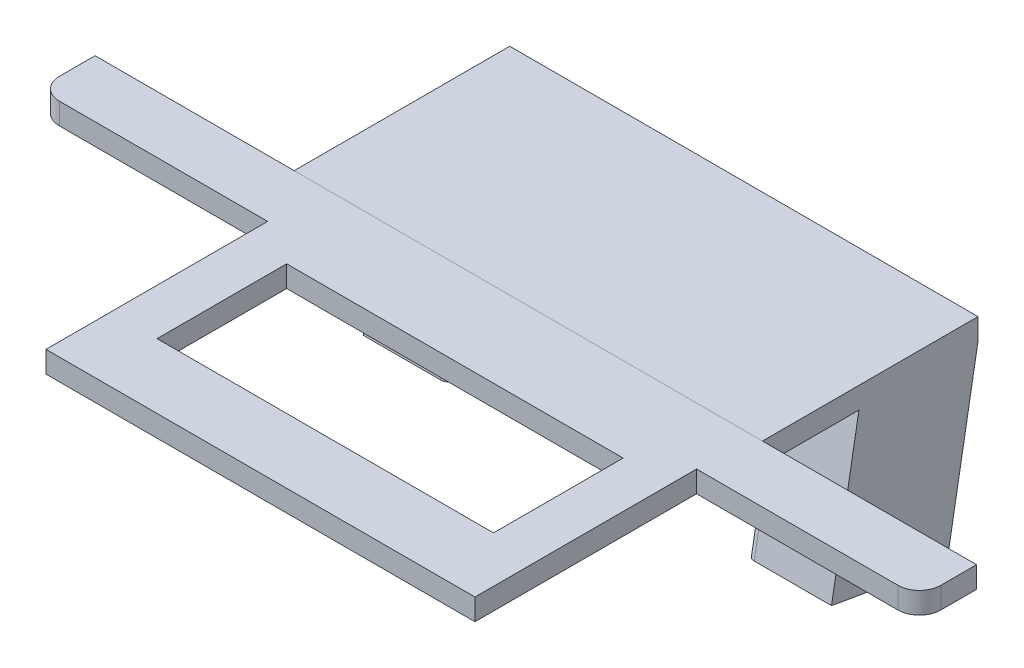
ISO-10303-21;
HEADER;
FILE_DESCRIPTION(('STEP AP214'),'2;1');
FILE_NAME('part.step','',(''),(''),'','','');
FILE_SCHEMA(('AUTOMOTIVE_DESIGN { 1 0 10303 214 1 1 1 1 }'));
ENDSEC;
DATA;
#1=APPLICATION_CONTEXT('core data for automotive mechanical design processes');
#2=APPLICATION_PROTOCOL_DEFINITION('international standard','automotive_design',2000,#1);
#3=PRODUCT_CONTEXT('',#1,'mechanical');
#4=PRODUCT('Part','Part','',(#3));
#5=PRODUCT_RELATED_PRODUCT_CATEGORY('part','',(#4));
#6=PRODUCT_DEFINITION_FORMATION('','',#4);
#7=PRODUCT_DEFINITION_CONTEXT('part definition',#1,'design');
#8=PRODUCT_DEFINITION('design','',#6,#7);
#9=PRODUCT_DEFINITION_SHAPE('','',#8);
#10=(LENGTH_UNIT() NAMED_UNIT(*) SI_UNIT(.MILLI.,.METRE.));
#11=(NAMED_UNIT(*) PLANE_ANGLE_UNIT() SI_UNIT($,.RADIAN.));
#12=(NAMED_UNIT(*) SI_UNIT($,.STERADIAN.) SOLID_ANGLE_UNIT());
#13=UNCERTAINTY_MEASURE_WITH_UNIT(LENGTH_MEASURE(1.E-05),#10,'distance_accuracy_value','');
#14=(GEOMETRIC_REPRESENTATION_CONTEXT(3) GLOBAL_UNCERTAINTY_ASSIGNED_CONTEXT((#13)) GLOBAL_UNIT_ASSIGNED_CONTEXT((#10,
#11,#12)) REPRESENTATION_CONTEXT('',''));
#15=CARTESIAN_POINT('',(0.,0.,0.));
#16=DIRECTION('',(0.,0.,1.));
#17=DIRECTION('',(1.,0.,0.));
#18=AXIS2_PLACEMENT_3D('',#15,#16,#17);
#19=CARTESIAN_POINT('',(0.,-18.7801966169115,3.31145536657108));
#20=DIRECTION('',(0.,-0.984807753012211,0.173648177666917));
#21=DIRECTION('',(0.,-0.173648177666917,-0.98480775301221));
#22=AXIS2_PLACEMENT_3D('',#19,#20,#21);
#23=PLANE('',#22);
#24=DIRECTION('',(-1.,0.,0.));
#25=VECTOR('',#24,1.);
#26=CARTESIAN_POINT('',(-2.48583846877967,-22.1196600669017,-15.6275829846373));
#27=LINE('',#26,#25);
#28=CARTESIAN_POINT('',(6.51416153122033,-22.1196600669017,-15.6275829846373));
#29=VERTEX_POINT('',#28);
#30=CARTESIAN_POINT('',(-2.48583846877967,-22.1196600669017,-15.6275829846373));
#31=VERTEX_POINT('',#30);
#32=EDGE_CURVE('E246',#29,#31,#27,.T.);
#33=ORIENTED_EDGE('',*,*,#32,.F.);
#34=CARTESIAN_POINT('',(6.51416153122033,-21.9460118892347,-14.6427752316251));
#35=DIRECTION('',(0.,-0.984807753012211,0.173648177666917));
#36=DIRECTION('',(0.,-0.173648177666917,-0.98480775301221));
#37=AXIS2_PLACEMENT_3D('',#34,#35,#36);
#38=CIRCLE('',#37,1.);
#39=CARTESIAN_POINT('',(7.51416153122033,-21.9460118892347,-14.6427752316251));
#40=VERTEX_POINT('',#39);
#41=EDGE_CURVE('E345',#29,#40,#38,.T.);
#42=ORIENTED_EDGE('',*,*,#41,.T.);
#43=CARTESIAN_POINT('',(6.51416153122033,-21.9460118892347,-14.6427752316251));
#44=DIRECTION('',(0.,-0.984807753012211,0.173648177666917));
#45=DIRECTION('',(0.,-0.173648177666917,-0.98480775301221));
#46=AXIS2_PLACEMENT_3D('',#43,#44,#45);
#47=CIRCLE('',#46,1.);
#48=CARTESIAN_POINT('',(6.51416153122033,-21.7723637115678,-13.6579674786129));
#49=VERTEX_POINT('',#48);
#50=EDGE_CURVE('E336',#40,#49,#47,.T.);
#51=ORIENTED_EDGE('',*,*,#50,.T.);
#52=DIRECTION('',(-1.,0.,0.));
#53=VECTOR('',#52,1.);
#54=CARTESIAN_POINT('',(61.2141615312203,-21.7723637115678,-13.6579674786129));
#55=LINE('',#54,#53);
#56=CARTESIAN_POINT('',(-4.28583846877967,-21.7723637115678,-13.6579674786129));
#57=VERTEX_POINT('',#56);
#58=EDGE_CURVE('E263',#49,#57,#55,.T.);
#59=ORIENTED_EDGE('',*,*,#58,.T.);
#60=DIRECTION('',(0.,-0.173648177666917,-0.98480775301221));
#61=VECTOR('',#60,1.);
#62=CARTESIAN_POINT('',(-4.28583846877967,-24.6201938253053,-29.8088146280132));
#63=LINE('',#62,#61);
#64=CARTESIAN_POINT('',(-4.28583846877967,-24.6201938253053,-29.8088146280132));
#65=VERTEX_POINT('',#64);
#66=EDGE_CURVE('E267',#57,#65,#63,.T.);
#67=ORIENTED_EDGE('',*,*,#66,.T.);
#68=DIRECTION('',(1.,0.,0.));
#69=VECTOR('',#68,1.);
#70=CARTESIAN_POINT('',(61.2141615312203,-24.6201938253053,-29.8088146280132));
#71=LINE('',#70,#69);
#72=CARTESIAN_POINT('',(6.51416153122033,-24.6201938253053,-29.8088146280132));
#73=VERTEX_POINT('',#72);
#74=EDGE_CURVE('E270',#65,#73,#71,.T.);
#75=ORIENTED_EDGE('',*,*,#74,.T.);
#76=CARTESIAN_POINT('',(6.51416153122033,-24.4465456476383,-28.8240068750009));
#77=DIRECTION('',(0.,-0.984807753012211,0.173648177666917));
#78=DIRECTION('',(0.,-0.173648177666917,-0.98480775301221));
#79=AXIS2_PLACEMENT_3D('',#76,#77,#78);
#80=CIRCLE('',#79,1.);
#81=CARTESIAN_POINT('',(7.51416153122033,-24.4465456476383,-28.8240068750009));
#82=VERTEX_POINT('',#81);
#83=EDGE_CURVE('E328',#73,#82,#80,.T.);
#84=ORIENTED_EDGE('',*,*,#83,.T.);
#85=CARTESIAN_POINT('',(6.51416153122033,-24.4465456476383,-28.8240068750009));
#86=DIRECTION('',(0.,-0.984807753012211,0.173648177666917));
#87=DIRECTION('',(0.,-0.173648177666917,-0.98480775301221));
#88=AXIS2_PLACEMENT_3D('',#85,#86,#87);
#89=CIRCLE('',#88,1.);
#90=CARTESIAN_POINT('',(6.51416153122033,-24.2728974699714,-27.8391991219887));
#91=VERTEX_POINT('',#90);
#92=EDGE_CURVE('E319',#82,#91,#89,.T.);
#93=ORIENTED_EDGE('',*,*,#92,.T.);
#94=DIRECTION('',(1.,0.,0.));
#95=VECTOR('',#94,1.);
#96=CARTESIAN_POINT('',(7.51416153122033,-24.2728974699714,-27.8391991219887));
#97=LINE('',#96,#95);
#98=CARTESIAN_POINT('',(-2.48583846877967,-24.2728974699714,-27.8391991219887));
#99=VERTEX_POINT('',#98);
#100=EDGE_CURVE('E251',#99,#91,#97,.T.);
#101=ORIENTED_EDGE('',*,*,#100,.F.);
#102=DIRECTION('',(0.,-0.173648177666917,-0.98480775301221));
#103=VECTOR('',#102,1.);
#104=CARTESIAN_POINT('',(-2.48583846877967,-24.2728974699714,-27.8391991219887));
#105=LINE('',#104,#103);
#106=EDGE_CURVE('E248',#31,#99,#105,.T.);
#107=ORIENTED_EDGE('',*,*,#106,.F.);
#108=EDGE_LOOP('',(#33,#42,#51,#59,#67,#75,#84,#93,#101,#107));
#109=FACE_BOUND('',#108,.T.);
#110=ADVANCED_FACE('F47',(#109),#23,.T.);
#111=CARTESIAN_POINT('',(0.,0.,0.));
#112=DIRECTION('',(0.,-1.,0.));
#113=DIRECTION('',(0.,0.,-1.));
#114=AXIS2_PLACEMENT_3D('',#111,#112,#113);
#115=PLANE('',#114);
#116=DIRECTION('',(0.,0.,-1.));
#117=VECTOR('',#116,1.);
#118=CARTESIAN_POINT('',(-4.28583846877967,0.,0.));
#119=LINE('',#118,#117);
#120=CARTESIAN_POINT('',(-4.28583846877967,0.,-4.));
#121=VERTEX_POINT('',#120);
#122=CARTESIAN_POINT('',(-4.28583846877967,0.,-17.4970226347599));
#123=VERTEX_POINT('',#122);
#124=EDGE_CURVE('E302',#121,#123,#119,.T.);
#125=ORIENTED_EDGE('',*,*,#124,.T.);
#126=DIRECTION('',(1.,0.,0.));
#127=VECTOR('',#126,1.);
#128=CARTESIAN_POINT('',(0.,0.,-17.4970226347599));
#129=LINE('',#128,#127);
#130=CARTESIAN_POINT('',(61.2141615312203,0.,-17.4970226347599));
#131=VERTEX_POINT('',#130);
#132=EDGE_CURVE('E308',#123,#131,#129,.T.);
#133=ORIENTED_EDGE('',*,*,#132,.T.);
#134=DIRECTION('',(0.,0.,-1.));
#135=VECTOR('',#134,1.);
#136=CARTESIAN_POINT('',(61.2141615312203,0.,0.));
#137=LINE('',#136,#135);
#138=CARTESIAN_POINT('',(61.2141615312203,0.,-4.));
#139=VERTEX_POINT('',#138);
#140=EDGE_CURVE('E285',#139,#131,#137,.T.);
#141=ORIENTED_EDGE('',*,*,#140,.F.);
#142=DIRECTION('',(1.,0.,0.));
#143=VECTOR('',#142,1.);
#144=CARTESIAN_POINT('',(0.,0.,-4.));
#145=LINE('',#144,#143);
#146=EDGE_CURVE('E300',#121,#139,#145,.T.);
#147=ORIENTED_EDGE('',*,*,#146,.F.);
#148=EDGE_LOOP('',(#125,#133,#141,#147));
#149=FACE_BOUND('',#148,.T.);
#150=ADVANCED_FACE('F460',(#149),#115,.T.);
#151=CARTESIAN_POINT('',(61.2141615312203,3.,0.));
#152=DIRECTION('',(-1.,0.,0.));
#153=DIRECTION('',(0.,0.,1.));
#154=AXIS2_PLACEMENT_3D('',#151,#152,#153);
#155=PLANE('',#154);
#156=ORIENTED_EDGE('',*,*,#140,.T.);
#157=DIRECTION('',(0.,0.98480775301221,-0.173648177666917));
#158=VECTOR('',#157,1.);
#159=CARTESIAN_POINT('',(61.2141615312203,-21.7723637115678,-13.6579674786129));
#160=LINE('',#159,#158);
#161=CARTESIAN_POINT('',(61.2141615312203,-21.7723637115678,-13.6579674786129));
#162=VERTEX_POINT('',#161);
#163=EDGE_CURVE('E282',#162,#131,#160,.T.);
#164=ORIENTED_EDGE('',*,*,#163,.F.);
#165=DIRECTION('',(0.,0.173648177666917,0.98480775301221));
#166=VECTOR('',#165,1.);
#167=CARTESIAN_POINT('',(61.2141615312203,-24.6201938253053,-29.8088146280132));
#168=LINE('',#167,#166);
#169=CARTESIAN_POINT('',(61.2141615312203,-24.6201938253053,-29.8088146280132));
#170=VERTEX_POINT('',#169);
#171=EDGE_CURVE('E256',#170,#162,#168,.T.);
#172=ORIENTED_EDGE('',*,*,#171,.F.);
#173=DIRECTION('',(0.,0.98480775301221,-0.173648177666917));
#174=VECTOR('',#173,1.);
#175=CARTESIAN_POINT('',(61.2141615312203,-24.6201938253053,-29.8088146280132));
#176=LINE('',#175,#174);
#177=CARTESIAN_POINT('',(61.2141615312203,0.,-34.1500190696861));
#178=VERTEX_POINT('',#177);
#179=EDGE_CURVE('E273',#170,#178,#176,.T.);
#180=ORIENTED_EDGE('',*,*,#179,.T.);
#181=DIRECTION('',(0.,-1.,0.));
#182=VECTOR('',#181,1.);
#183=CARTESIAN_POINT('',(61.2141615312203,3.,-34.1500190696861));
#184=LINE('',#183,#182);
#185=CARTESIAN_POINT('',(61.2141615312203,3.,-34.1500190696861));
#186=VERTEX_POINT('',#185);
#187=EDGE_CURVE('E306',#186,#178,#184,.T.);
#188=ORIENTED_EDGE('',*,*,#187,.F.);
#189=DIRECTION('',(0.,0.,-1.));
#190=VECTOR('',#189,1.);
#191=CARTESIAN_POINT('',(61.2141615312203,3.,0.));
#192=LINE('',#191,#190);
#193=CARTESIAN_POINT('',(61.2141615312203,3.,-4.));
#194=VERTEX_POINT('',#193);
#195=EDGE_CURVE('E286',#194,#186,#192,.T.);
#196=ORIENTED_EDGE('',*,*,#195,.F.);
#197=DIRECTION('',(0.,-1.,0.));
#198=VECTOR('',#197,1.);
#199=CARTESIAN_POINT('',(61.2141615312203,3.,-4.));
#200=LINE('',#199,#198);
#201=EDGE_CURVE('E297',#194,#139,#200,.T.);
#202=ORIENTED_EDGE('',*,*,#201,.T.);
#203=EDGE_LOOP('',(#156,#164,#172,#180,#188,#196,#202));
#204=FACE_BOUND('',#203,.T.);
#205=ADVANCED_FACE('F400',(#204),#155,.F.);
#206=CARTESIAN_POINT('',(0.,3.,-34.1500190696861));
#207=DIRECTION('',(0.,0.,-1.));
#208=DIRECTION('',(-1.,0.,0.));
#209=AXIS2_PLACEMENT_3D('',#206,#207,#208);
#210=PLANE('',#209);
#211=DIRECTION('',(1.,0.,0.));
#212=VECTOR('',#211,1.);
#213=CARTESIAN_POINT('',(0.,0.,-34.1500190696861));
#214=LINE('',#213,#212);
#215=CARTESIAN_POINT('',(-4.28583846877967,0.,-34.1500190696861));
#216=VERTEX_POINT('',#215);
#217=EDGE_CURVE('E289',#216,#178,#214,.T.);
#218=ORIENTED_EDGE('',*,*,#217,.F.);
#219=DIRECTION('',(0.,-1.,0.));
#220=VECTOR('',#219,1.);
#221=CARTESIAN_POINT('',(-4.28583846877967,3.,-34.1500190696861));
#222=LINE('',#221,#220);
#223=CARTESIAN_POINT('',(-4.28583846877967,3.,-34.1500190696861));
#224=VERTEX_POINT('',#223);
#225=EDGE_CURVE('E309',#224,#216,#222,.T.);
#226=ORIENTED_EDGE('',*,*,#225,.F.);
#227=DIRECTION('',(1.,0.,0.));
#228=VECTOR('',#227,1.);
#229=CARTESIAN_POINT('',(0.,3.,-34.1500190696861));
#230=LINE('',#229,#228);
#231=EDGE_CURVE('E294',#224,#186,#230,.T.);
#232=ORIENTED_EDGE('',*,*,#231,.T.);
#233=ORIENTED_EDGE('',*,*,#187,.T.);
#234=EDGE_LOOP('',(#218,#226,#232,#233));
#235=FACE_BOUND('',#234,.T.);
#236=ADVANCED_FACE('F451',(#235),#210,.T.);
#237=CARTESIAN_POINT('',(-4.28583846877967,3.,0.));
#238=DIRECTION('',(-1.,0.,0.));
#239=DIRECTION('',(0.,0.,1.));
#240=AXIS2_PLACEMENT_3D('',#237,#238,#239);
#241=PLANE('',#240);
#242=DIRECTION('',(0.,0.98480775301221,-0.173648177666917));
#243=VECTOR('',#242,1.);
#244=CARTESIAN_POINT('',(-4.28583846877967,-21.7723637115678,-13.6579674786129));
#245=LINE('',#244,#243);
#246=EDGE_CURVE('E279',#57,#123,#245,.T.);
#247=ORIENTED_EDGE('',*,*,#246,.T.);
#248=ORIENTED_EDGE('',*,*,#124,.F.);
#249=DIRECTION('',(0.,-1.,0.));
#250=VECTOR('',#249,1.);
#251=CARTESIAN_POINT('',(-4.28583846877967,3.,-4.));
#252=LINE('',#251,#250);
#253=CARTESIAN_POINT('',(-4.28583846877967,3.,-4.));
#254=VERTEX_POINT('',#253);
#255=EDGE_CURVE('E311',#254,#121,#252,.T.);
#256=ORIENTED_EDGE('',*,*,#255,.F.);
#257=DIRECTION('',(0.,0.,-1.));
#258=VECTOR('',#257,1.);
#259=CARTESIAN_POINT('',(-4.28583846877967,3.,0.));
#260=LINE('',#259,#258);
#261=EDGE_CURVE('E291',#254,#224,#260,.T.);
#262=ORIENTED_EDGE('',*,*,#261,.T.);
#263=ORIENTED_EDGE('',*,*,#225,.T.);
#264=DIRECTION('',(0.,0.98480775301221,-0.173648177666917));
#265=VECTOR('',#264,1.);
#266=CARTESIAN_POINT('',(-4.28583846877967,-24.6201938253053,-29.8088146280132));
#267=LINE('',#266,#265);
#268=EDGE_CURVE('E276',#65,#216,#267,.T.);
#269=ORIENTED_EDGE('',*,*,#268,.F.);
#270=ORIENTED_EDGE('',*,*,#66,.F.);
#271=EDGE_LOOP('',(#247,#248,#256,#262,#263,#269,#270));
#272=FACE_BOUND('',#271,.T.);
#273=ADVANCED_FACE('F410',(#272),#241,.T.);
#274=CARTESIAN_POINT('',(0.,3.,-4.));
#275=DIRECTION('',(0.,0.,-1.));
#276=DIRECTION('',(-1.,0.,0.));
#277=AXIS2_PLACEMENT_3D('',#274,#275,#276);
#278=PLANE('',#277);
#279=ORIENTED_EDGE('',*,*,#146,.T.);
#280=ORIENTED_EDGE('',*,*,#201,.F.);
#281=DIRECTION('',(1.,0.,0.));
#282=VECTOR('',#281,1.);
#283=CARTESIAN_POINT('',(0.,3.,-4.));
#284=LINE('',#283,#282);
#285=EDGE_CURVE('E288',#254,#194,#284,.T.);
#286=ORIENTED_EDGE('',*,*,#285,.F.);
#287=ORIENTED_EDGE('',*,*,#255,.T.);
#288=EDGE_LOOP('',(#279,#280,#286,#287));
#289=FACE_BOUND('',#288,.T.);
#290=ADVANCED_FACE('F458',(#289),#278,.F.);
#291=CARTESIAN_POINT('',(0.,3.,0.));
#292=DIRECTION('',(0.,-1.,0.));
#293=DIRECTION('',(0.,0.,-1.));
#294=AXIS2_PLACEMENT_3D('',#291,#292,#293);
#295=PLANE('',#294);
#296=ORIENTED_EDGE('',*,*,#195,.T.);
#297=ORIENTED_EDGE('',*,*,#231,.F.);
#298=ORIENTED_EDGE('',*,*,#261,.F.);
#299=ORIENTED_EDGE('',*,*,#285,.T.);
#300=EDGE_LOOP('',(#296,#297,#298,#299));
#301=FACE_BOUND('',#300,.T.);
#302=ADVANCED_FACE('F454',(#301),#295,.F.);
#303=CARTESIAN_POINT('',(61.2141615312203,-21.7723637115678,-13.6579674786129));
#304=DIRECTION('',(0.,-0.173648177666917,-0.98480775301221));
#305=DIRECTION('',(0.,0.984807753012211,-0.173648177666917));
#306=AXIS2_PLACEMENT_3D('',#303,#304,#305);
#307=PLANE('',#306);
#308=DIRECTION('',(-1.,0.,0.));
#309=VECTOR('',#308,1.);
#310=CARTESIAN_POINT('',(7.51416153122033,-0.106593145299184,-17.4782273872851));
#311=LINE('',#310,#309);
#312=CARTESIAN_POINT('',(50.4141615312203,-0.106593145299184,-17.4782273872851));
#313=VERTEX_POINT('',#312);
#314=CARTESIAN_POINT('',(6.51416153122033,-0.106593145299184,-17.4782273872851));
#315=VERTEX_POINT('',#314);
#316=EDGE_CURVE('E62',#313,#315,#311,.T.);
#317=ORIENTED_EDGE('',*,*,#316,.F.);
#318=DIRECTION('',(0.,-0.984807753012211,0.173648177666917));
#319=VECTOR('',#318,1.);
#320=CARTESIAN_POINT('',(50.4141615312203,-21.7723637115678,-13.6579674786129));
#321=LINE('',#320,#319);
#322=CARTESIAN_POINT('',(50.4141615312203,-21.7723637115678,-13.6579674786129));
#323=VERTEX_POINT('',#322);
#324=EDGE_CURVE('E373',#313,#323,#321,.T.);
#325=ORIENTED_EDGE('',*,*,#324,.T.);
#326=EDGE_CURVE('E264',#162,#323,#55,.T.);
#327=ORIENTED_EDGE('',*,*,#326,.F.);
#328=ORIENTED_EDGE('',*,*,#163,.T.);
#329=ORIENTED_EDGE('',*,*,#132,.F.);
#330=ORIENTED_EDGE('',*,*,#246,.F.);
#331=ORIENTED_EDGE('',*,*,#58,.F.);
#332=DIRECTION('',(0.,-0.984807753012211,0.173648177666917));
#333=VECTOR('',#332,1.);
#334=CARTESIAN_POINT('',(6.51416153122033,-21.7723637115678,-13.6579674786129));
#335=LINE('',#334,#333);
#336=EDGE_CURVE('E338',#49,#315,#335,.F.);
#337=ORIENTED_EDGE('',*,*,#336,.T.);
#338=EDGE_LOOP('',(#317,#325,#327,#328,#329,#330,#331,#337));
#339=FACE_BOUND('',#338,.T.);
#340=ADVANCED_FACE('F403',(#339),#307,.F.);
#341=CARTESIAN_POINT('',(61.2141615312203,-24.6201938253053,-29.8088146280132));
#342=DIRECTION('',(0.,0.173648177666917,0.98480775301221));
#343=DIRECTION('',(0.,-0.984807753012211,0.173648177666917));
#344=AXIS2_PLACEMENT_3D('',#341,#342,#343);
#345=PLANE('',#344);
#346=CARTESIAN_POINT('',(50.4141615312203,-24.6201938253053,-29.8088146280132));
#347=VERTEX_POINT('',#346);
#348=EDGE_CURVE('E269',#347,#170,#71,.T.);
#349=ORIENTED_EDGE('',*,*,#348,.F.);
#350=DIRECTION('',(0.,-0.984807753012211,0.173648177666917));
#351=VECTOR('',#350,1.);
#352=CARTESIAN_POINT('',(50.4141615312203,-24.6201938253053,-29.8088146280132));
#353=LINE('',#352,#351);
#354=CARTESIAN_POINT('',(50.4141615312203,-2.95442325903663,-33.6290745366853));
#355=VERTEX_POINT('',#354);
#356=EDGE_CURVE('E360',#347,#355,#353,.F.);
#357=ORIENTED_EDGE('',*,*,#356,.T.);
#358=DIRECTION('',(1.,0.,0.));
#359=VECTOR('',#358,1.);
#360=CARTESIAN_POINT('',(49.4141615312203,-2.95442325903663,-33.6290745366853));
#361=LINE('',#360,#359);
#362=CARTESIAN_POINT('',(6.51416153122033,-2.95442325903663,-33.6290745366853));
#363=VERTEX_POINT('',#362);
#364=EDGE_CURVE('E212',#363,#355,#361,.T.);
#365=ORIENTED_EDGE('',*,*,#364,.F.);
#366=DIRECTION('',(0.,-0.984807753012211,0.173648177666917));
#367=VECTOR('',#366,1.);
#368=CARTESIAN_POINT('',(6.51416153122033,-24.6201938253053,-29.8088146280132));
#369=LINE('',#368,#367);
#370=EDGE_CURVE('E325',#363,#73,#369,.T.);
#371=ORIENTED_EDGE('',*,*,#370,.T.);
#372=ORIENTED_EDGE('',*,*,#74,.F.);
#373=ORIENTED_EDGE('',*,*,#268,.T.);
#374=ORIENTED_EDGE('',*,*,#217,.T.);
#375=ORIENTED_EDGE('',*,*,#179,.F.);
#376=EDGE_LOOP('',(#349,#357,#365,#371,#372,#373,#374,#375));
#377=FACE_BOUND('',#376,.T.);
#378=ADVANCED_FACE('F395',(#377),#345,.F.);
#379=ORIENTED_EDGE('',*,*,#326,.T.);
#380=CARTESIAN_POINT('',(50.4141615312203,-21.9460118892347,-14.6427752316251));
#381=DIRECTION('',(0.,-0.984807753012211,0.173648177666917));
#382=DIRECTION('',(0.,-0.173648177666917,-0.98480775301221));
#383=AXIS2_PLACEMENT_3D('',#380,#381,#382);
#384=CIRCLE('',#383,1.);
#385=CARTESIAN_POINT('',(49.4141615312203,-21.9460118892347,-14.6427752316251));
#386=VERTEX_POINT('',#385);
#387=EDGE_CURVE('E55',#323,#386,#384,.T.);
#388=ORIENTED_EDGE('',*,*,#387,.T.);
#389=CARTESIAN_POINT('',(50.4141615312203,-21.9460118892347,-14.6427752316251));
#390=DIRECTION('',(0.,-0.984807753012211,0.173648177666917));
#391=DIRECTION('',(0.,-0.173648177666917,-0.98480775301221));
#392=AXIS2_PLACEMENT_3D('',#389,#390,#391);
#393=CIRCLE('',#392,1.);
#394=CARTESIAN_POINT('',(50.4141615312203,-22.1196600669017,-15.6275829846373));
#395=VERTEX_POINT('',#394);
#396=EDGE_CURVE('E367',#386,#395,#393,.T.);
#397=ORIENTED_EDGE('',*,*,#396,.T.);
#398=DIRECTION('',(-1.,0.,0.));
#399=VECTOR('',#398,1.);
#400=CARTESIAN_POINT('',(49.4141615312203,-22.1196600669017,-15.6275829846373));
#401=LINE('',#400,#399);
#402=CARTESIAN_POINT('',(59.4141615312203,-22.1196600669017,-15.6275829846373));
#403=VERTEX_POINT('',#402);
#404=EDGE_CURVE('E243',#403,#395,#401,.T.);
#405=ORIENTED_EDGE('',*,*,#404,.F.);
#406=DIRECTION('',(0.,0.173648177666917,0.98480775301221));
#407=VECTOR('',#406,1.);
#408=CARTESIAN_POINT('',(59.4141615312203,-22.1196600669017,-15.6275829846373));
#409=LINE('',#408,#407);
#410=CARTESIAN_POINT('',(59.4141615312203,-24.2728974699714,-27.8391991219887));
#411=VERTEX_POINT('',#410);
#412=EDGE_CURVE('E241',#411,#403,#409,.T.);
#413=ORIENTED_EDGE('',*,*,#412,.F.);
#414=DIRECTION('',(1.,0.,0.));
#415=VECTOR('',#414,1.);
#416=CARTESIAN_POINT('',(59.4141615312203,-24.2728974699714,-27.8391991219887));
#417=LINE('',#416,#415);
#418=CARTESIAN_POINT('',(50.4141615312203,-24.2728974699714,-27.8391991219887));
#419=VERTEX_POINT('',#418);
#420=EDGE_CURVE('E218',#419,#411,#417,.T.);
#421=ORIENTED_EDGE('',*,*,#420,.F.);
#422=CARTESIAN_POINT('',(50.4141615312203,-24.4465456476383,-28.8240068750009));
#423=DIRECTION('',(0.,-0.984807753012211,0.173648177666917));
#424=DIRECTION('',(0.,-0.173648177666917,-0.98480775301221));
#425=AXIS2_PLACEMENT_3D('',#422,#423,#424);
#426=CIRCLE('',#425,1.);
#427=CARTESIAN_POINT('',(49.4141615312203,-24.4465456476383,-28.8240068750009));
#428=VERTEX_POINT('',#427);
#429=EDGE_CURVE('E351',#419,#428,#426,.T.);
#430=ORIENTED_EDGE('',*,*,#429,.T.);
#431=CARTESIAN_POINT('',(50.4141615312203,-24.4465456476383,-28.8240068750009));
#432=DIRECTION('',(0.,-0.984807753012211,0.173648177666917));
#433=DIRECTION('',(0.,-0.173648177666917,-0.98480775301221));
#434=AXIS2_PLACEMENT_3D('',#431,#432,#433);
#435=CIRCLE('',#434,1.);
#436=EDGE_CURVE('E358',#428,#347,#435,.T.);
#437=ORIENTED_EDGE('',*,*,#436,.T.);
#438=ORIENTED_EDGE('',*,*,#348,.T.);
#439=ORIENTED_EDGE('',*,*,#171,.T.);
#440=EDGE_LOOP('',(#379,#388,#397,#405,#413,#421,#430,#437,#438,#439));
#441=FACE_BOUND('',#440,.T.);
#442=ADVANCED_FACE('F376',(#441),#23,.T.);
#443=CARTESIAN_POINT('',(7.51416153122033,-2.60712690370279,-31.6594590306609));
#444=DIRECTION('',(0.,-0.173648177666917,-0.98480775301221));
#445=DIRECTION('',(0.,0.98480775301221,-0.173648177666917));
#446=AXIS2_PLACEMENT_3D('',#443,#444,#445);
#447=PLANE('',#446);
#448=ORIENTED_EDGE('',*,*,#100,.T.);
#449=DIRECTION('',(0.,-0.98480775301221,0.173648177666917));
#450=VECTOR('',#449,1.);
#451=CARTESIAN_POINT('',(6.51416153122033,-2.60712690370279,-31.6594590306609));
#452=LINE('',#451,#450);
#453=CARTESIAN_POINT('',(6.51416153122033,-2.60712690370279,-31.6594590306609));
#454=VERTEX_POINT('',#453);
#455=EDGE_CURVE('E321',#91,#454,#452,.F.);
#456=ORIENTED_EDGE('',*,*,#455,.T.);
#457=DIRECTION('',(1.,0.,0.));
#458=VECTOR('',#457,1.);
#459=CARTESIAN_POINT('',(7.51416153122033,-2.60712690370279,-31.6594590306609));
#460=LINE('',#459,#458);
#461=CARTESIAN_POINT('',(-2.48583846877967,-2.60712690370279,-31.6594590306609));
#462=VERTEX_POINT('',#461);
#463=EDGE_CURVE('E223',#462,#454,#460,.T.);
#464=ORIENTED_EDGE('',*,*,#463,.F.);
#465=DIRECTION('',(0.,-0.98480775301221,0.173648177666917));
#466=VECTOR('',#465,1.);
#467=CARTESIAN_POINT('',(-2.48583846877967,-2.60712690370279,-31.6594590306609));
#468=LINE('',#467,#466);
#469=EDGE_CURVE('E254',#462,#99,#468,.T.);
#470=ORIENTED_EDGE('',*,*,#469,.T.);
#471=EDGE_LOOP('',(#448,#456,#464,#470));
#472=FACE_BOUND('',#471,.T.);
#473=ADVANCED_FACE('F520',(#472),#447,.F.);
#474=CARTESIAN_POINT('',(-2.48583846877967,-2.60712690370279,-31.6594590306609));
#475=DIRECTION('',(-1.,0.,0.));
#476=DIRECTION('',(0.,0.,1.));
#477=AXIS2_PLACEMENT_3D('',#474,#475,#476);
#478=PLANE('',#477);
#479=ORIENTED_EDGE('',*,*,#106,.T.);
#480=ORIENTED_EDGE('',*,*,#469,.F.);
#481=DIRECTION('',(0.,-0.173648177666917,-0.98480775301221));
#482=VECTOR('',#481,1.);
#483=CARTESIAN_POINT('',(-2.48583846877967,-2.60712690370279,-31.6594590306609));
#484=LINE('',#483,#482);
#485=CARTESIAN_POINT('',(-2.48583846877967,-0.45388950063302,-19.4478428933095));
#486=VERTEX_POINT('',#485);
#487=EDGE_CURVE('E235',#486,#462,#484,.T.);
#488=ORIENTED_EDGE('',*,*,#487,.F.);
#489=DIRECTION('',(0.,-0.98480775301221,0.173648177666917));
#490=VECTOR('',#489,1.);
#491=CARTESIAN_POINT('',(-2.48583846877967,-0.45388950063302,-19.4478428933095));
#492=LINE('',#491,#490);
#493=EDGE_CURVE('E257',#486,#31,#492,.T.);
#494=ORIENTED_EDGE('',*,*,#493,.T.);
#495=EDGE_LOOP('',(#479,#480,#488,#494));
#496=FACE_BOUND('',#495,.T.);
#497=ADVANCED_FACE('F433',(#496),#478,.F.);
#498=CARTESIAN_POINT('',(-2.48583846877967,-0.45388950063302,-19.4478428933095));
#499=DIRECTION('',(0.,0.173648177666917,0.98480775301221));
#500=DIRECTION('',(0.,-0.98480775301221,0.173648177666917));
#501=AXIS2_PLACEMENT_3D('',#498,#499,#500);
#502=PLANE('',#501);
#503=DIRECTION('',(-1.,0.,0.));
#504=VECTOR('',#503,1.);
#505=CARTESIAN_POINT('',(-2.48583846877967,-0.45388950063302,-19.4478428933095));
#506=LINE('',#505,#504);
#507=CARTESIAN_POINT('',(6.51416153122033,-0.45388950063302,-19.4478428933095));
#508=VERTEX_POINT('',#507);
#509=EDGE_CURVE('E233',#508,#486,#506,.T.);
#510=ORIENTED_EDGE('',*,*,#509,.F.);
#511=DIRECTION('',(0.,-0.98480775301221,0.173648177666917));
#512=VECTOR('',#511,1.);
#513=CARTESIAN_POINT('',(6.51416153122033,-0.45388950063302,-19.4478428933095));
#514=LINE('',#513,#512);
#515=EDGE_CURVE('E342',#508,#29,#514,.T.);
#516=ORIENTED_EDGE('',*,*,#515,.T.);
#517=ORIENTED_EDGE('',*,*,#32,.T.);
#518=ORIENTED_EDGE('',*,*,#493,.F.);
#519=EDGE_LOOP('',(#510,#516,#517,#518));
#520=FACE_BOUND('',#519,.T.);
#521=ADVANCED_FACE('F427',(#520),#502,.F.);
#522=CARTESIAN_POINT('',(49.4141615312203,-0.45388950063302,-19.4478428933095));
#523=DIRECTION('',(0.,0.173648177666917,0.98480775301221));
#524=DIRECTION('',(0.,-0.98480775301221,0.173648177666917));
#525=AXIS2_PLACEMENT_3D('',#522,#523,#524);
#526=PLANE('',#525);
#527=ORIENTED_EDGE('',*,*,#404,.T.);
#528=DIRECTION('',(0.,-0.98480775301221,0.173648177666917));
#529=VECTOR('',#528,1.);
#530=CARTESIAN_POINT('',(50.4141615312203,-0.45388950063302,-19.4478428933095));
#531=LINE('',#530,#529);
#532=CARTESIAN_POINT('',(50.4141615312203,-0.45388950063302,-19.4478428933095));
#533=VERTEX_POINT('',#532);
#534=EDGE_CURVE('E369',#395,#533,#531,.F.);
#535=ORIENTED_EDGE('',*,*,#534,.T.);
#536=DIRECTION('',(-1.,0.,0.));
#537=VECTOR('',#536,1.);
#538=CARTESIAN_POINT('',(49.4141615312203,-0.45388950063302,-19.4478428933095));
#539=LINE('',#538,#537);
#540=CARTESIAN_POINT('',(59.4141615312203,-0.45388950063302,-19.4478428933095));
#541=VERTEX_POINT('',#540);
#542=EDGE_CURVE('E227',#541,#533,#539,.T.);
#543=ORIENTED_EDGE('',*,*,#542,.F.);
#544=DIRECTION('',(0.,-0.98480775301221,0.173648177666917));
#545=VECTOR('',#544,1.);
#546=CARTESIAN_POINT('',(59.4141615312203,-0.45388950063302,-19.4478428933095));
#547=LINE('',#546,#545);
#548=EDGE_CURVE('E222',#541,#403,#547,.T.);
#549=ORIENTED_EDGE('',*,*,#548,.T.);
#550=EDGE_LOOP('',(#527,#535,#543,#549));
#551=FACE_BOUND('',#550,.T.);
#552=ADVANCED_FACE('F385',(#551),#526,.F.);
#553=CARTESIAN_POINT('',(59.4141615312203,-0.45388950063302,-19.4478428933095));
#554=DIRECTION('',(1.,0.,0.));
#555=DIRECTION('',(0.,1.,0.));
#556=AXIS2_PLACEMENT_3D('',#553,#554,#555);
#557=PLANE('',#556);
#558=ORIENTED_EDGE('',*,*,#412,.T.);
#559=ORIENTED_EDGE('',*,*,#548,.F.);
#560=DIRECTION('',(0.,0.173648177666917,0.98480775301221));
#561=VECTOR('',#560,1.);
#562=CARTESIAN_POINT('',(59.4141615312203,-0.45388950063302,-19.4478428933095));
#563=LINE('',#562,#561);
#564=CARTESIAN_POINT('',(59.4141615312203,-2.60712690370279,-31.6594590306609));
#565=VERTEX_POINT('',#564);
#566=EDGE_CURVE('E206',#565,#541,#563,.T.);
#567=ORIENTED_EDGE('',*,*,#566,.F.);
#568=DIRECTION('',(0.,-0.98480775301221,0.173648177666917));
#569=VECTOR('',#568,1.);
#570=CARTESIAN_POINT('',(59.4141615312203,-2.60712690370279,-31.6594590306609));
#571=LINE('',#570,#569);
#572=EDGE_CURVE('E215',#565,#411,#571,.T.);
#573=ORIENTED_EDGE('',*,*,#572,.T.);
#574=EDGE_LOOP('',(#558,#559,#567,#573));
#575=FACE_BOUND('',#574,.T.);
#576=ADVANCED_FACE('F225',(#575),#557,.F.);
#577=CARTESIAN_POINT('',(59.4141615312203,-2.60712690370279,-31.6594590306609));
#578=DIRECTION('',(0.,-0.173648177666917,-0.98480775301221));
#579=DIRECTION('',(0.,0.98480775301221,-0.173648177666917));
#580=AXIS2_PLACEMENT_3D('',#577,#578,#579);
#581=PLANE('',#580);
#582=DIRECTION('',(1.,0.,0.));
#583=VECTOR('',#582,1.);
#584=CARTESIAN_POINT('',(59.4141615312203,-2.60712690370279,-31.6594590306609));
#585=LINE('',#584,#583);
#586=CARTESIAN_POINT('',(50.4141615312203,-2.60712690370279,-31.6594590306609));
#587=VERTEX_POINT('',#586);
#588=EDGE_CURVE('E201',#587,#565,#585,.T.);
#589=ORIENTED_EDGE('',*,*,#588,.F.);
#590=DIRECTION('',(0.,-0.98480775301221,0.173648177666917));
#591=VECTOR('',#590,1.);
#592=CARTESIAN_POINT('',(50.4141615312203,-2.60712690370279,-31.6594590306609));
#593=LINE('',#592,#591);
#594=EDGE_CURVE('E349',#587,#419,#593,.T.);
#595=ORIENTED_EDGE('',*,*,#594,.T.);
#596=ORIENTED_EDGE('',*,*,#420,.T.);
#597=ORIENTED_EDGE('',*,*,#572,.F.);
#598=EDGE_LOOP('',(#589,#595,#596,#597));
#599=FACE_BOUND('',#598,.T.);
#600=ADVANCED_FACE('F216',(#599),#581,.F.);
#601=CARTESIAN_POINT('',(0.,2.88557394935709,-0.508804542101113));
#602=DIRECTION('',(0.,0.984807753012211,-0.173648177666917));
#603=DIRECTION('',(0.,0.173648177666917,0.984807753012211));
#604=AXIS2_PLACEMENT_3D('',#601,#602,#603);
#605=PLANE('',#604);
#606=ORIENTED_EDGE('',*,*,#364,.T.);
#607=CARTESIAN_POINT('',(50.4141615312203,-2.78077508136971,-32.6442667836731));
#608=DIRECTION('',(0.,0.984807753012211,-0.173648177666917));
#609=DIRECTION('',(0.,0.173648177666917,0.984807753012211));
#610=AXIS2_PLACEMENT_3D('',#607,#608,#609);
#611=CIRCLE('',#610,1.);
#612=CARTESIAN_POINT('',(49.4141615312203,-2.78077508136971,-32.6442667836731));
#613=VERTEX_POINT('',#612);
#614=EDGE_CURVE('E363',#355,#613,#611,.T.);
#615=ORIENTED_EDGE('',*,*,#614,.T.);
#616=CARTESIAN_POINT('',(50.4141615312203,-2.78077508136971,-32.6442667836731));
#617=DIRECTION('',(0.,0.984807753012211,-0.173648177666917));
#618=DIRECTION('',(0.,0.173648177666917,0.984807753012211));
#619=AXIS2_PLACEMENT_3D('',#616,#617,#618);
#620=CIRCLE('',#619,1.);
#621=EDGE_CURVE('E208',#613,#587,#620,.T.);
#622=ORIENTED_EDGE('',*,*,#621,.T.);
#623=ORIENTED_EDGE('',*,*,#588,.T.);
#624=ORIENTED_EDGE('',*,*,#566,.T.);
#625=ORIENTED_EDGE('',*,*,#542,.T.);
#626=CARTESIAN_POINT('',(50.4141615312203,-0.280241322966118,-18.4630351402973));
#627=DIRECTION('',(0.,0.984807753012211,-0.173648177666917));
#628=DIRECTION('',(0.,0.173648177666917,0.984807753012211));
#629=AXIS2_PLACEMENT_3D('',#626,#627,#628);
#630=CIRCLE('',#629,1.);
#631=CARTESIAN_POINT('',(49.4141615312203,-0.280241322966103,-18.4630351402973));
#632=VERTEX_POINT('',#631);
#633=EDGE_CURVE('E371',#533,#632,#630,.T.);
#634=ORIENTED_EDGE('',*,*,#633,.T.);
#635=CARTESIAN_POINT('',(50.4141615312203,-0.280241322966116,-18.4630351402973));
#636=DIRECTION('',(0.,0.984807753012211,-0.173648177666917));
#637=DIRECTION('',(0.,0.173648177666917,0.984807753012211));
#638=AXIS2_PLACEMENT_3D('',#635,#636,#637);
#639=CIRCLE('',#638,1.);
#640=EDGE_CURVE('E12',#632,#313,#639,.T.);
#641=ORIENTED_EDGE('',*,*,#640,.T.);
#642=ORIENTED_EDGE('',*,*,#316,.T.);
#643=CARTESIAN_POINT('',(6.51416153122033,-0.280241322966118,-18.4630351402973));
#644=DIRECTION('',(0.,0.984807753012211,-0.173648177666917));
#645=DIRECTION('',(0.,0.173648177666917,0.984807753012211));
#646=AXIS2_PLACEMENT_3D('',#643,#644,#645);
#647=CIRCLE('',#646,1.);
#648=CARTESIAN_POINT('',(7.51416153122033,-0.280241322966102,-18.4630351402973));
#649=VERTEX_POINT('',#648);
#650=EDGE_CURVE('E340',#315,#649,#647,.T.);
#651=ORIENTED_EDGE('',*,*,#650,.T.);
#652=CARTESIAN_POINT('',(6.51416153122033,-0.280241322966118,-18.4630351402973));
#653=DIRECTION('',(0.,0.984807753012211,-0.173648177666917));
#654=DIRECTION('',(0.,0.173648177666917,0.984807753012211));
#655=AXIS2_PLACEMENT_3D('',#652,#653,#654);
#656=CIRCLE('',#655,1.);
#657=EDGE_CURVE('E347',#649,#508,#656,.T.);
#658=ORIENTED_EDGE('',*,*,#657,.T.);
#659=ORIENTED_EDGE('',*,*,#509,.T.);
#660=ORIENTED_EDGE('',*,*,#487,.T.);
#661=ORIENTED_EDGE('',*,*,#463,.T.);
#662=CARTESIAN_POINT('',(6.51416153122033,-2.78077508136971,-32.6442667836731));
#663=DIRECTION('',(0.,0.984807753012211,-0.173648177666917));
#664=DIRECTION('',(0.,0.173648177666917,0.984807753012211));
#665=AXIS2_PLACEMENT_3D('',#662,#663,#664);
#666=CIRCLE('',#665,1.);
#667=CARTESIAN_POINT('',(7.51416153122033,-2.7807750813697,-32.6442667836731));
#668=VERTEX_POINT('',#667);
#669=EDGE_CURVE('E323',#454,#668,#666,.T.);
#670=ORIENTED_EDGE('',*,*,#669,.T.);
#671=CARTESIAN_POINT('',(6.51416153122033,-2.78077508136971,-32.6442667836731));
#672=DIRECTION('',(0.,0.984807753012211,-0.173648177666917));
#673=DIRECTION('',(0.,0.173648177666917,0.984807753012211));
#674=AXIS2_PLACEMENT_3D('',#671,#672,#673);
#675=CIRCLE('',#674,1.);
#676=EDGE_CURVE('E330',#668,#363,#675,.T.);
#677=ORIENTED_EDGE('',*,*,#676,.T.);
#678=EDGE_LOOP('',(#606,#615,#622,#623,#624,#625,#634,#641,#642,#651,#658,#659,#660,#661,#670,#677));
#679=FACE_BOUND('',#678,.T.);
#680=ADVANCED_FACE('F203',(#679),#605,.F.);
#681=CARTESIAN_POINT('',(6.51416153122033,-2.7807750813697,-32.6442667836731));
#682=DIRECTION('',(0.,-0.98480775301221,0.173648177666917));
#683=DIRECTION('',(0.,-0.173648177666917,-0.98480775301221));
#684=AXIS2_PLACEMENT_3D('',#681,#682,#683);
#685=CYLINDRICAL_SURFACE('',#684,1.);
#686=ORIENTED_EDGE('',*,*,#669,.F.);
#687=ORIENTED_EDGE('',*,*,#455,.F.);
#688=ORIENTED_EDGE('',*,*,#92,.F.);
#689=DIRECTION('',(0.,-0.98480775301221,0.173648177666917));
#690=VECTOR('',#689,1.);
#691=CARTESIAN_POINT('',(7.51416153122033,-2.7807750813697,-32.6442667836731));
#692=LINE('',#691,#690);
#693=EDGE_CURVE('E316',#668,#82,#692,.T.);
#694=ORIENTED_EDGE('',*,*,#693,.F.);
#695=EDGE_LOOP('',(#686,#687,#688,#694));
#696=FACE_BOUND('',#695,.T.);
#697=ADVANCED_FACE('F440',(#696),#685,.T.);
#698=CARTESIAN_POINT('',(6.51416153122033,-24.4465456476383,-28.8240068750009));
#699=DIRECTION('',(0.,-0.984807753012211,0.173648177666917));
#700=DIRECTION('',(0.,-0.173648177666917,-0.98480775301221));
#701=AXIS2_PLACEMENT_3D('',#698,#699,#700);
#702=CYLINDRICAL_SURFACE('',#701,1.);
#703=ORIENTED_EDGE('',*,*,#676,.F.);
#704=ORIENTED_EDGE('',*,*,#693,.T.);
#705=ORIENTED_EDGE('',*,*,#83,.F.);
#706=ORIENTED_EDGE('',*,*,#370,.F.);
#707=EDGE_LOOP('',(#703,#704,#705,#706));
#708=FACE_BOUND('',#707,.T.);
#709=ADVANCED_FACE('F445',(#708),#702,.T.);
#710=CARTESIAN_POINT('',(6.51416153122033,-0.280241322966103,-18.4630351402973));
#711=DIRECTION('',(0.,-0.984807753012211,0.173648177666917));
#712=DIRECTION('',(0.,-0.173648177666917,-0.98480775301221));
#713=AXIS2_PLACEMENT_3D('',#710,#711,#712);
#714=CYLINDRICAL_SURFACE('',#713,1.);
#715=ORIENTED_EDGE('',*,*,#650,.F.);
#716=ORIENTED_EDGE('',*,*,#336,.F.);
#717=ORIENTED_EDGE('',*,*,#50,.F.);
#718=DIRECTION('',(0.,-0.984807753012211,0.173648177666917));
#719=VECTOR('',#718,1.);
#720=CARTESIAN_POINT('',(7.51416153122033,-0.280241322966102,-18.4630351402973));
#721=LINE('',#720,#719);
#722=EDGE_CURVE('E333',#649,#40,#721,.T.);
#723=ORIENTED_EDGE('',*,*,#722,.F.);
#724=EDGE_LOOP('',(#715,#716,#717,#723));
#725=FACE_BOUND('',#724,.T.);
#726=ADVANCED_FACE('F419',(#725),#714,.T.);
#727=CARTESIAN_POINT('',(6.51416153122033,-0.280241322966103,-18.4630351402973));
#728=DIRECTION('',(0.,-0.98480775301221,0.173648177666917));
#729=DIRECTION('',(0.,-0.173648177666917,-0.98480775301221));
#730=AXIS2_PLACEMENT_3D('',#727,#728,#729);
#731=CYLINDRICAL_SURFACE('',#730,1.);
#732=ORIENTED_EDGE('',*,*,#657,.F.);
#733=ORIENTED_EDGE('',*,*,#722,.T.);
#734=ORIENTED_EDGE('',*,*,#41,.F.);
#735=ORIENTED_EDGE('',*,*,#515,.F.);
#736=EDGE_LOOP('',(#732,#733,#734,#735));
#737=FACE_BOUND('',#736,.T.);
#738=ADVANCED_FACE('F429',(#737),#731,.T.);
#739=CARTESIAN_POINT('',(50.4141615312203,-2.78077508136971,-32.6442667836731));
#740=DIRECTION('',(0.,-0.98480775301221,0.173648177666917));
#741=DIRECTION('',(0.,-0.173648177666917,-0.98480775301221));
#742=AXIS2_PLACEMENT_3D('',#739,#740,#741);
#743=CYLINDRICAL_SURFACE('',#742,1.);
#744=ORIENTED_EDGE('',*,*,#621,.F.);
#745=DIRECTION('',(0.,-0.98480775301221,0.173648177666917));
#746=VECTOR('',#745,1.);
#747=CARTESIAN_POINT('',(49.4141615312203,-2.78077508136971,-32.6442667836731));
#748=LINE('',#747,#746);
#749=EDGE_CURVE('E354',#428,#613,#748,.F.);
#750=ORIENTED_EDGE('',*,*,#749,.F.);
#751=ORIENTED_EDGE('',*,*,#429,.F.);
#752=ORIENTED_EDGE('',*,*,#594,.F.);
#753=EDGE_LOOP('',(#744,#750,#751,#752));
#754=FACE_BOUND('',#753,.T.);
#755=ADVANCED_FACE('F389',(#754),#743,.T.);
#756=CARTESIAN_POINT('',(50.4141615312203,-2.78077508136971,-32.6442667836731));
#757=DIRECTION('',(0.,-0.984807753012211,0.173648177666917));
#758=DIRECTION('',(0.,-0.173648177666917,-0.98480775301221));
#759=AXIS2_PLACEMENT_3D('',#756,#757,#758);
#760=CYLINDRICAL_SURFACE('',#759,1.);
#761=ORIENTED_EDGE('',*,*,#614,.F.);
#762=ORIENTED_EDGE('',*,*,#356,.F.);
#763=ORIENTED_EDGE('',*,*,#436,.F.);
#764=ORIENTED_EDGE('',*,*,#749,.T.);
#765=EDGE_LOOP('',(#761,#762,#763,#764));
#766=FACE_BOUND('',#765,.T.);
#767=ADVANCED_FACE('F392',(#766),#760,.T.);
#768=CARTESIAN_POINT('',(50.4141615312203,-0.280241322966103,-18.4630351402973));
#769=DIRECTION('',(0.,-0.98480775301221,0.173648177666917));
#770=DIRECTION('',(0.,-0.173648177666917,-0.98480775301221));
#771=AXIS2_PLACEMENT_3D('',#768,#769,#770);
#772=CYLINDRICAL_SURFACE('',#771,1.);
#773=ORIENTED_EDGE('',*,*,#633,.F.);
#774=ORIENTED_EDGE('',*,*,#534,.F.);
#775=ORIENTED_EDGE('',*,*,#396,.F.);
#776=DIRECTION('',(0.,-0.98480775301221,0.173648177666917));
#777=VECTOR('',#776,1.);
#778=CARTESIAN_POINT('',(49.4141615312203,-0.280241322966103,-18.4630351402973));
#779=LINE('',#778,#777);
#780=EDGE_CURVE('E365',#632,#386,#779,.T.);
#781=ORIENTED_EDGE('',*,*,#780,.F.);
#782=EDGE_LOOP('',(#773,#774,#775,#781));
#783=FACE_BOUND('',#782,.T.);
#784=ADVANCED_FACE('F382',(#783),#772,.T.);
#785=CARTESIAN_POINT('',(50.4141615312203,-21.9460118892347,-14.6427752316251));
#786=DIRECTION('',(0.,-0.984807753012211,0.173648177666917));
#787=DIRECTION('',(0.,-0.173648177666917,-0.98480775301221));
#788=AXIS2_PLACEMENT_3D('',#785,#786,#787);
#789=CYLINDRICAL_SURFACE('',#788,1.);
#790=ORIENTED_EDGE('',*,*,#640,.F.);
#791=ORIENTED_EDGE('',*,*,#780,.T.);
#792=ORIENTED_EDGE('',*,*,#387,.F.);
#793=ORIENTED_EDGE('',*,*,#324,.F.);
#794=EDGE_LOOP('',(#790,#791,#792,#793));
#795=FACE_BOUND('',#794,.T.);
#796=ADVANCED_FACE('F49',(#795),#789,.T.);
#797=CLOSED_SHELL('',(#110,#150,#205,#236,#273,#290,#302,#340,#378,#442,#473,#497,#521,#552,
#576,#600,#680,#697,#709,#726,#738,#755,#767,#784,#796));
#798=MANIFOLD_SOLID_BREP('B2',#797);
#799=CARTESIAN_POINT('',(0.,3.,0.));
#800=DIRECTION('',(1.,0.,0.));
#801=DIRECTION('',(0.,0.,-1.));
#802=AXIS2_PLACEMENT_3D('',#799,#800,#801);
#803=PLANE('',#802);
#804=DIRECTION('',(0.,0.,1.));
#805=VECTOR('',#804,1.);
#806=CARTESIAN_POINT('',(0.,3.,0.));
#807=LINE('',#806,#805);
#808=CARTESIAN_POINT('',(0.,3.,4.));
#809=VERTEX_POINT('',#808);
#810=CARTESIAN_POINT('',(0.,3.,35.));
#811=VERTEX_POINT('',#810);
#812=EDGE_CURVE('E837',#809,#811,#807,.T.);
#813=ORIENTED_EDGE('',*,*,#812,.F.);
#814=DIRECTION('',(0.,-1.,0.));
#815=VECTOR('',#814,1.);
#816=CARTESIAN_POINT('',(0.,3.,4.));
#817=LINE('',#816,#815);
#818=CARTESIAN_POINT('',(0.,0.,4.));
#819=VERTEX_POINT('',#818);
#820=EDGE_CURVE('E833',#809,#819,#817,.T.);
#821=ORIENTED_EDGE('',*,*,#820,.T.);
#822=DIRECTION('',(0.,0.,1.));
#823=VECTOR('',#822,1.);
#824=CARTESIAN_POINT('',(0.,0.,0.));
#825=LINE('',#824,#823);
#826=CARTESIAN_POINT('',(0.,0.,35.));
#827=VERTEX_POINT('',#826);
#828=EDGE_CURVE('E836',#819,#827,#825,.T.);
#829=ORIENTED_EDGE('',*,*,#828,.T.);
#830=DIRECTION('',(0.,-1.,0.));
#831=VECTOR('',#830,1.);
#832=CARTESIAN_POINT('',(0.,3.,35.));
#833=LINE('',#832,#831);
#834=EDGE_CURVE('E853',#811,#827,#833,.T.);
#835=ORIENTED_EDGE('',*,*,#834,.F.);
#836=EDGE_LOOP('',(#813,#821,#829,#835));
#837=FACE_BOUND('',#836,.T.);
#838=ADVANCED_FACE('F668',(#837),#803,.F.);
#839=CARTESIAN_POINT('',(0.,3.,35.));
#840=DIRECTION('',(0.,0.,-1.));
#841=DIRECTION('',(-1.,0.,0.));
#842=AXIS2_PLACEMENT_3D('',#839,#840,#841);
#843=PLANE('',#842);
#844=DIRECTION('',(1.,0.,0.));
#845=VECTOR('',#844,1.);
#846=CARTESIAN_POINT('',(0.,0.,35.));
#847=LINE('',#846,#845);
#848=CARTESIAN_POINT('',(60.,0.,35.));
#849=VERTEX_POINT('',#848);
#850=EDGE_CURVE('E847',#827,#849,#847,.T.);
#851=ORIENTED_EDGE('',*,*,#850,.T.);
#852=DIRECTION('',(0.,-1.,0.));
#853=VECTOR('',#852,1.);
#854=CARTESIAN_POINT('',(60.,3.,35.));
#855=LINE('',#854,#853);
#856=CARTESIAN_POINT('',(60.,3.,35.));
#857=VERTEX_POINT('',#856);
#858=EDGE_CURVE('E845',#857,#849,#855,.T.);
#859=ORIENTED_EDGE('',*,*,#858,.F.);
#860=DIRECTION('',(1.,0.,0.));
#861=VECTOR('',#860,1.);
#862=CARTESIAN_POINT('',(0.,3.,35.));
#863=LINE('',#862,#861);
#864=EDGE_CURVE('E839',#811,#857,#863,.T.);
#865=ORIENTED_EDGE('',*,*,#864,.F.);
#866=ORIENTED_EDGE('',*,*,#834,.T.);
#867=EDGE_LOOP('',(#851,#859,#865,#866));
#868=FACE_BOUND('',#867,.T.);
#869=ADVANCED_FACE('F911',(#868),#843,.F.);
#870=CARTESIAN_POINT('',(60.,3.,0.));
#871=DIRECTION('',(1.,0.,0.));
#872=DIRECTION('',(0.,0.,-1.));
#873=AXIS2_PLACEMENT_3D('',#870,#871,#872);
#874=PLANE('',#873);
#875=DIRECTION('',(0.,-1.,0.));
#876=VECTOR('',#875,1.);
#877=CARTESIAN_POINT('',(60.,3.,4.));
#878=LINE('',#877,#876);
#879=CARTESIAN_POINT('',(60.,3.,4.));
#880=VERTEX_POINT('',#879);
#881=CARTESIAN_POINT('',(60.,0.,4.));
#882=VERTEX_POINT('',#881);
#883=EDGE_CURVE('E828',#880,#882,#878,.T.);
#884=ORIENTED_EDGE('',*,*,#883,.F.);
#885=DIRECTION('',(0.,0.,1.));
#886=VECTOR('',#885,1.);
#887=CARTESIAN_POINT('',(60.,3.,0.));
#888=LINE('',#887,#886);
#889=EDGE_CURVE('E843',#880,#857,#888,.T.);
#890=ORIENTED_EDGE('',*,*,#889,.T.);
#891=ORIENTED_EDGE('',*,*,#858,.T.);
#892=DIRECTION('',(0.,0.,1.));
#893=VECTOR('',#892,1.);
#894=CARTESIAN_POINT('',(60.,0.,0.));
#895=LINE('',#894,#893);
#896=EDGE_CURVE('E840',#882,#849,#895,.T.);
#897=ORIENTED_EDGE('',*,*,#896,.F.);
#898=EDGE_LOOP('',(#884,#890,#891,#897));
#899=FACE_BOUND('',#898,.T.);
#900=ADVANCED_FACE('F914',(#899),#874,.T.);
#901=CARTESIAN_POINT('',(0.,3.,0.));
#902=DIRECTION('',(0.,1.,0.));
#903=DIRECTION('',(0.,0.,1.));
#904=AXIS2_PLACEMENT_3D('',#901,#902,#903);
#905=PLANE('',#904);
#906=DIRECTION('',(0.,0.,1.));
#907=VECTOR('',#906,1.);
#908=CARTESIAN_POINT('',(6.46848524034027,3.,0.));
#909=LINE('',#908,#907);
#910=CARTESIAN_POINT('',(6.46848524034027,3.,7.80830054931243));
#911=VERTEX_POINT('',#910);
#912=CARTESIAN_POINT('',(6.46848524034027,3.,25.9361001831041));
#913=VERTEX_POINT('',#912);
#914=EDGE_CURVE('E801',#911,#913,#909,.T.);
#915=ORIENTED_EDGE('',*,*,#914,.F.);
#916=DIRECTION('',(-1.,0.,0.));
#917=VECTOR('',#916,1.);
#918=CARTESIAN_POINT('',(0.,3.,7.80830054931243));
#919=LINE('',#918,#917);
#920=CARTESIAN_POINT('',(53.5315147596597,3.,7.80830054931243));
#921=VERTEX_POINT('',#920);
#922=EDGE_CURVE('E794',#921,#911,#919,.T.);
#923=ORIENTED_EDGE('',*,*,#922,.F.);
#924=DIRECTION('',(0.,0.,-1.));
#925=VECTOR('',#924,1.);
#926=CARTESIAN_POINT('',(53.5315147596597,3.,0.));
#927=LINE('',#926,#925);
#928=CARTESIAN_POINT('',(53.5315147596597,3.,25.9361001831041));
#929=VERTEX_POINT('',#928);
#930=EDGE_CURVE('E774',#929,#921,#927,.T.);
#931=ORIENTED_EDGE('',*,*,#930,.F.);
#932=DIRECTION('',(1.,0.,0.));
#933=VECTOR('',#932,1.);
#934=CARTESIAN_POINT('',(0.,3.,25.9361001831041));
#935=LINE('',#934,#933);
#936=EDGE_CURVE('E799',#913,#929,#935,.T.);
#937=ORIENTED_EDGE('',*,*,#936,.F.);
#938=EDGE_LOOP('',(#915,#923,#931,#937));
#939=FACE_BOUND('',#938,.T.);
#940=DIRECTION('',(-1.,0.,0.));
#941=VECTOR('',#940,1.);
#942=CARTESIAN_POINT('',(-32.1358384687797,3.,4.));
#943=LINE('',#942,#941);
#944=CARTESIAN_POINT('',(88.1641615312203,3.,4.));
#945=VERTEX_POINT('',#944);
#946=EDGE_CURVE('E809',#945,#880,#943,.T.);
#947=ORIENTED_EDGE('',*,*,#946,.F.);
#948=CARTESIAN_POINT('',(88.1641615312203,3.,1.));
#949=DIRECTION('',(0.,1.,0.));
#950=DIRECTION('',(0.,0.,1.));
#951=AXIS2_PLACEMENT_3D('',#948,#949,#950);
#952=CIRCLE('',#951,3.);
#953=CARTESIAN_POINT('',(91.1641615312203,3.,1.));
#954=VERTEX_POINT('',#953);
#955=EDGE_CURVE('E45',#945,#954,#952,.T.);
#956=ORIENTED_EDGE('',*,*,#955,.T.);
#957=DIRECTION('',(0.,0.,1.));
#958=VECTOR('',#957,1.);
#959=CARTESIAN_POINT('',(91.1641615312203,3.,4.));
#960=LINE('',#959,#958);
#961=CARTESIAN_POINT('',(91.1641615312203,3.,-4.));
#962=VERTEX_POINT('',#961);
#963=EDGE_CURVE('E804',#962,#954,#960,.T.);
#964=ORIENTED_EDGE('',*,*,#963,.F.);
#965=DIRECTION('',(1.,0.,0.));
#966=VECTOR('',#965,1.);
#967=CARTESIAN_POINT('',(-32.1358384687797,3.,-4.));
#968=LINE('',#967,#966);
#969=CARTESIAN_POINT('',(-32.1358384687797,3.,-4.));
#970=VERTEX_POINT('',#969);
#971=EDGE_CURVE('E813',#970,#962,#968,.T.);
#972=ORIENTED_EDGE('',*,*,#971,.F.);
#973=DIRECTION('',(0.,0.,-1.));
#974=VECTOR('',#973,1.);
#975=CARTESIAN_POINT('',(-32.1358384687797,3.,4.));
#976=LINE('',#975,#974);
#977=CARTESIAN_POINT('',(-32.1358384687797,3.,1.));
#978=VERTEX_POINT('',#977);
#979=EDGE_CURVE('E811',#978,#970,#976,.T.);
#980=ORIENTED_EDGE('',*,*,#979,.F.);
#981=CARTESIAN_POINT('',(-29.1358384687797,3.,1.));
#982=DIRECTION('',(0.,1.,0.));
#983=DIRECTION('',(0.,0.,1.));
#984=AXIS2_PLACEMENT_3D('',#981,#982,#983);
#985=CIRCLE('',#984,3.);
#986=CARTESIAN_POINT('',(-29.1358384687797,3.,4.));
#987=VERTEX_POINT('',#986);
#988=EDGE_CURVE('E863',#978,#987,#985,.T.);
#989=ORIENTED_EDGE('',*,*,#988,.T.);
#990=EDGE_CURVE('E807',#809,#987,#943,.T.);
#991=ORIENTED_EDGE('',*,*,#990,.F.);
#992=ORIENTED_EDGE('',*,*,#812,.T.);
#993=ORIENTED_EDGE('',*,*,#864,.T.);
#994=ORIENTED_EDGE('',*,*,#889,.F.);
#995=EDGE_LOOP('',(#947,#956,#964,#972,#980,#989,#991,#992,#993,#994));
#996=FACE_BOUND('',#995,.T.);
#997=ADVANCED_FACE('F879',(#939,#996),#905,.T.);
#998=CARTESIAN_POINT('',(0.,0.,0.));
#999=DIRECTION('',(0.,1.,0.));
#1000=DIRECTION('',(0.,0.,1.));
#1001=AXIS2_PLACEMENT_3D('',#998,#999,#1000);
#1002=PLANE('',#1001);
#1003=DIRECTION('',(1.,0.,0.));
#1004=VECTOR('',#1003,1.);
#1005=CARTESIAN_POINT('',(53.5315147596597,0.,7.80830054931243));
#1006=LINE('',#1005,#1004);
#1007=CARTESIAN_POINT('',(6.46848524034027,0.,7.80830054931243));
#1008=VERTEX_POINT('',#1007);
#1009=CARTESIAN_POINT('',(53.5315147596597,0.,7.80830054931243));
#1010=VERTEX_POINT('',#1009);
#1011=EDGE_CURVE('E780',#1008,#1010,#1006,.T.);
#1012=ORIENTED_EDGE('',*,*,#1011,.F.);
#1013=DIRECTION('',(0.,0.,-1.));
#1014=VECTOR('',#1013,1.);
#1015=CARTESIAN_POINT('',(6.46848524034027,0.,7.80830054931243));
#1016=LINE('',#1015,#1014);
#1017=CARTESIAN_POINT('',(6.46848524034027,0.,25.9361001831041));
#1018=VERTEX_POINT('',#1017);
#1019=EDGE_CURVE('E691',#1018,#1008,#1016,.T.);
#1020=ORIENTED_EDGE('',*,*,#1019,.F.);
#1021=DIRECTION('',(-1.,0.,0.));
#1022=VECTOR('',#1021,1.);
#1023=CARTESIAN_POINT('',(53.5315147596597,0.,25.9361001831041));
#1024=LINE('',#1023,#1022);
#1025=CARTESIAN_POINT('',(53.5315147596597,0.,25.9361001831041));
#1026=VERTEX_POINT('',#1025);
#1027=EDGE_CURVE('E787',#1026,#1018,#1024,.T.);
#1028=ORIENTED_EDGE('',*,*,#1027,.F.);
#1029=DIRECTION('',(0.,0.,1.));
#1030=VECTOR('',#1029,1.);
#1031=CARTESIAN_POINT('',(53.5315147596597,0.,7.80830054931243));
#1032=LINE('',#1031,#1030);
#1033=EDGE_CURVE('E771',#1010,#1026,#1032,.T.);
#1034=ORIENTED_EDGE('',*,*,#1033,.F.);
#1035=EDGE_LOOP('',(#1012,#1020,#1028,#1034));
#1036=FACE_BOUND('',#1035,.T.);
#1037=DIRECTION('',(0.,0.,1.));
#1038=VECTOR('',#1037,1.);
#1039=CARTESIAN_POINT('',(91.1641615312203,0.,4.));
#1040=LINE('',#1039,#1038);
#1041=CARTESIAN_POINT('',(91.1641615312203,0.,-4.));
#1042=VERTEX_POINT('',#1041);
#1043=CARTESIAN_POINT('',(91.1641615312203,0.,1.));
#1044=VERTEX_POINT('',#1043);
#1045=EDGE_CURVE('E803',#1042,#1044,#1040,.T.);
#1046=ORIENTED_EDGE('',*,*,#1045,.T.);
#1047=CARTESIAN_POINT('',(88.1641615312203,0.,1.));
#1048=DIRECTION('',(0.,1.,0.));
#1049=DIRECTION('',(0.,0.,1.));
#1050=AXIS2_PLACEMENT_3D('',#1047,#1048,#1049);
#1051=CIRCLE('',#1050,3.);
#1052=CARTESIAN_POINT('',(88.1641615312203,0.,4.));
#1053=VERTEX_POINT('',#1052);
#1054=EDGE_CURVE('E868',#1044,#1053,#1051,.F.);
#1055=ORIENTED_EDGE('',*,*,#1054,.T.);
#1056=DIRECTION('',(-1.,0.,0.));
#1057=VECTOR('',#1056,1.);
#1058=CARTESIAN_POINT('',(-32.1358384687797,0.,4.));
#1059=LINE('',#1058,#1057);
#1060=EDGE_CURVE('E820',#1053,#882,#1059,.T.);
#1061=ORIENTED_EDGE('',*,*,#1060,.T.);
#1062=ORIENTED_EDGE('',*,*,#896,.T.);
#1063=ORIENTED_EDGE('',*,*,#850,.F.);
#1064=ORIENTED_EDGE('',*,*,#828,.F.);
#1065=CARTESIAN_POINT('',(-29.1358384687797,0.,4.));
#1066=VERTEX_POINT('',#1065);
#1067=EDGE_CURVE('E819',#819,#1066,#1059,.T.);
#1068=ORIENTED_EDGE('',*,*,#1067,.T.);
#1069=CARTESIAN_POINT('',(-29.1358384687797,0.,1.));
#1070=DIRECTION('',(0.,1.,0.));
#1071=DIRECTION('',(0.,0.,1.));
#1072=AXIS2_PLACEMENT_3D('',#1069,#1070,#1071);
#1073=CIRCLE('',#1072,3.);
#1074=CARTESIAN_POINT('',(-32.1358384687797,0.,1.));
#1075=VERTEX_POINT('',#1074);
#1076=EDGE_CURVE('E859',#1066,#1075,#1073,.F.);
#1077=ORIENTED_EDGE('',*,*,#1076,.T.);
#1078=DIRECTION('',(0.,0.,-1.));
#1079=VECTOR('',#1078,1.);
#1080=CARTESIAN_POINT('',(-32.1358384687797,0.,4.));
#1081=LINE('',#1080,#1079);
#1082=CARTESIAN_POINT('',(-32.1358384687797,0.,-4.));
#1083=VERTEX_POINT('',#1082);
#1084=EDGE_CURVE('E822',#1075,#1083,#1081,.T.);
#1085=ORIENTED_EDGE('',*,*,#1084,.T.);
#1086=DIRECTION('',(1.,0.,0.));
#1087=VECTOR('',#1086,1.);
#1088=CARTESIAN_POINT('',(-32.1358384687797,0.,-4.));
#1089=LINE('',#1088,#1087);
#1090=EDGE_CURVE('E808',#1083,#1042,#1089,.T.);
#1091=ORIENTED_EDGE('',*,*,#1090,.T.);
#1092=EDGE_LOOP('',(#1046,#1055,#1061,#1062,#1063,#1064,#1068,#1077,#1085,#1091));
#1093=FACE_BOUND('',#1092,.T.);
#1094=ADVANCED_FACE('F784',(#1036,#1093),#1002,.F.);
#1095=CARTESIAN_POINT('',(-32.1358384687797,3.,4.));
#1096=DIRECTION('',(0.,0.,1.));
#1097=DIRECTION('',(1.,0.,0.));
#1098=AXIS2_PLACEMENT_3D('',#1095,#1096,#1097);
#1099=PLANE('',#1098);
#1100=ORIENTED_EDGE('',*,*,#990,.T.);
#1101=DIRECTION('',(0.,-1.,0.));
#1102=VECTOR('',#1101,1.);
#1103=CARTESIAN_POINT('',(-29.1358384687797,3.,4.));
#1104=LINE('',#1103,#1102);
#1105=EDGE_CURVE('E856',#987,#1066,#1104,.T.);
#1106=ORIENTED_EDGE('',*,*,#1105,.T.);
#1107=ORIENTED_EDGE('',*,*,#1067,.F.);
#1108=ORIENTED_EDGE('',*,*,#820,.F.);
#1109=EDGE_LOOP('',(#1100,#1106,#1107,#1108));
#1110=FACE_BOUND('',#1109,.T.);
#1111=ADVANCED_FACE('F902',(#1110),#1099,.T.);
#1112=CARTESIAN_POINT('',(91.1641615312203,3.,4.));
#1113=DIRECTION('',(1.,0.,0.));
#1114=DIRECTION('',(0.,0.,-1.));
#1115=AXIS2_PLACEMENT_3D('',#1112,#1113,#1114);
#1116=PLANE('',#1115);
#1117=ORIENTED_EDGE('',*,*,#963,.T.);
#1118=DIRECTION('',(0.,-1.,0.));
#1119=VECTOR('',#1118,1.);
#1120=CARTESIAN_POINT('',(91.1641615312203,3.,1.));
#1121=LINE('',#1120,#1119);
#1122=EDGE_CURVE('E865',#954,#1044,#1121,.T.);
#1123=ORIENTED_EDGE('',*,*,#1122,.T.);
#1124=ORIENTED_EDGE('',*,*,#1045,.F.);
#1125=DIRECTION('',(0.,-1.,0.));
#1126=VECTOR('',#1125,1.);
#1127=CARTESIAN_POINT('',(91.1641615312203,3.,-4.));
#1128=LINE('',#1127,#1126);
#1129=EDGE_CURVE('E826',#962,#1042,#1128,.T.);
#1130=ORIENTED_EDGE('',*,*,#1129,.F.);
#1131=EDGE_LOOP('',(#1117,#1123,#1124,#1130));
#1132=FACE_BOUND('',#1131,.T.);
#1133=ADVANCED_FACE('F884',(#1132),#1116,.T.);
#1134=CARTESIAN_POINT('',(-32.1358384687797,3.,-4.));
#1135=DIRECTION('',(0.,0.,-1.));
#1136=DIRECTION('',(-1.,0.,0.));
#1137=AXIS2_PLACEMENT_3D('',#1134,#1135,#1136);
#1138=PLANE('',#1137);
#1139=ORIENTED_EDGE('',*,*,#1090,.F.);
#1140=DIRECTION('',(0.,-1.,0.));
#1141=VECTOR('',#1140,1.);
#1142=CARTESIAN_POINT('',(-32.1358384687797,3.,-4.));
#1143=LINE('',#1142,#1141);
#1144=EDGE_CURVE('E816',#970,#1083,#1143,.T.);
#1145=ORIENTED_EDGE('',*,*,#1144,.F.);
#1146=ORIENTED_EDGE('',*,*,#971,.T.);
#1147=ORIENTED_EDGE('',*,*,#1129,.T.);
#1148=EDGE_LOOP('',(#1139,#1145,#1146,#1147));
#1149=FACE_BOUND('',#1148,.T.);
#1150=ADVANCED_FACE('F889',(#1149),#1138,.T.);
#1151=CARTESIAN_POINT('',(-32.1358384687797,3.,4.));
#1152=DIRECTION('',(-1.,0.,0.));
#1153=DIRECTION('',(0.,0.,1.));
#1154=AXIS2_PLACEMENT_3D('',#1151,#1152,#1153);
#1155=PLANE('',#1154);
#1156=ORIENTED_EDGE('',*,*,#1084,.F.);
#1157=DIRECTION('',(0.,-1.,0.));
#1158=VECTOR('',#1157,1.);
#1159=CARTESIAN_POINT('',(-32.1358384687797,3.,1.));
#1160=LINE('',#1159,#1158);
#1161=EDGE_CURVE('E861',#1075,#978,#1160,.F.);
#1162=ORIENTED_EDGE('',*,*,#1161,.T.);
#1163=ORIENTED_EDGE('',*,*,#979,.T.);
#1164=ORIENTED_EDGE('',*,*,#1144,.T.);
#1165=EDGE_LOOP('',(#1156,#1162,#1163,#1164));
#1166=FACE_BOUND('',#1165,.T.);
#1167=ADVANCED_FACE('F935',(#1166),#1155,.T.);
#1168=ORIENTED_EDGE('',*,*,#1060,.F.);
#1169=DIRECTION('',(0.,-1.,0.));
#1170=VECTOR('',#1169,1.);
#1171=CARTESIAN_POINT('',(88.1641615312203,3.,4.));
#1172=LINE('',#1171,#1170);
#1173=EDGE_CURVE('E676',#1053,#945,#1172,.F.);
#1174=ORIENTED_EDGE('',*,*,#1173,.T.);
#1175=ORIENTED_EDGE('',*,*,#946,.T.);
#1176=ORIENTED_EDGE('',*,*,#883,.T.);
#1177=EDGE_LOOP('',(#1168,#1174,#1175,#1176));
#1178=FACE_BOUND('',#1177,.T.);
#1179=ADVANCED_FACE('F873',(#1178),#1099,.T.);
#1180=CARTESIAN_POINT('',(-29.1358384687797,3.,1.));
#1181=DIRECTION('',(0.,-1.,0.));
#1182=DIRECTION('',(0.,0.,-1.));
#1183=AXIS2_PLACEMENT_3D('',#1180,#1181,#1182);
#1184=CYLINDRICAL_SURFACE('',#1183,3.);
#1185=ORIENTED_EDGE('',*,*,#988,.F.);
#1186=ORIENTED_EDGE('',*,*,#1161,.F.);
#1187=ORIENTED_EDGE('',*,*,#1076,.F.);
#1188=ORIENTED_EDGE('',*,*,#1105,.F.);
#1189=EDGE_LOOP('',(#1185,#1186,#1187,#1188));
#1190=FACE_BOUND('',#1189,.T.);
#1191=ADVANCED_FACE('F899',(#1190),#1184,.T.);
#1192=CARTESIAN_POINT('',(88.1641615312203,3.,1.));
#1193=DIRECTION('',(0.,-1.,0.));
#1194=DIRECTION('',(0.,0.,-1.));
#1195=AXIS2_PLACEMENT_3D('',#1192,#1193,#1194);
#1196=CYLINDRICAL_SURFACE('',#1195,3.);
#1197=ORIENTED_EDGE('',*,*,#955,.F.);
#1198=ORIENTED_EDGE('',*,*,#1173,.F.);
#1199=ORIENTED_EDGE('',*,*,#1054,.F.);
#1200=ORIENTED_EDGE('',*,*,#1122,.F.);
#1201=EDGE_LOOP('',(#1197,#1198,#1199,#1200));
#1202=FACE_BOUND('',#1201,.T.);
#1203=ADVANCED_FACE('F670',(#1202),#1196,.T.);
#1204=CARTESIAN_POINT('',(6.46848524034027,10.,7.80830054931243));
#1205=DIRECTION('',(-1.,0.,0.));
#1206=DIRECTION('',(0.,0.,1.));
#1207=AXIS2_PLACEMENT_3D('',#1204,#1205,#1206);
#1208=PLANE('',#1207);
#1209=ORIENTED_EDGE('',*,*,#914,.T.);
#1210=DIRECTION('',(0.,-1.,0.));
#1211=VECTOR('',#1210,1.);
#1212=CARTESIAN_POINT('',(6.46848524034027,10.,25.9361001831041));
#1213=LINE('',#1212,#1211);
#1214=EDGE_CURVE('E792',#913,#1018,#1213,.T.);
#1215=ORIENTED_EDGE('',*,*,#1214,.T.);
#1216=ORIENTED_EDGE('',*,*,#1019,.T.);
#1217=DIRECTION('',(0.,-1.,0.));
#1218=VECTOR('',#1217,1.);
#1219=CARTESIAN_POINT('',(6.46848524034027,10.,7.80830054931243));
#1220=LINE('',#1219,#1218);
#1221=EDGE_CURVE('E777',#911,#1008,#1220,.T.);
#1222=ORIENTED_EDGE('',*,*,#1221,.F.);
#1223=EDGE_LOOP('',(#1209,#1215,#1216,#1222));
#1224=FACE_BOUND('',#1223,.T.);
#1225=ADVANCED_FACE('F934',(#1224),#1208,.F.);
#1226=CARTESIAN_POINT('',(53.5315147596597,10.,25.9361001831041));
#1227=DIRECTION('',(0.,0.,1.));
#1228=DIRECTION('',(1.,0.,0.));
#1229=AXIS2_PLACEMENT_3D('',#1226,#1227,#1228);
#1230=PLANE('',#1229);
#1231=ORIENTED_EDGE('',*,*,#936,.T.);
#1232=DIRECTION('',(0.,-1.,0.));
#1233=VECTOR('',#1232,1.);
#1234=CARTESIAN_POINT('',(53.5315147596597,10.,25.9361001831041));
#1235=LINE('',#1234,#1233);
#1236=EDGE_CURVE('E776',#929,#1026,#1235,.T.);
#1237=ORIENTED_EDGE('',*,*,#1236,.T.);
#1238=ORIENTED_EDGE('',*,*,#1027,.T.);
#1239=ORIENTED_EDGE('',*,*,#1214,.F.);
#1240=EDGE_LOOP('',(#1231,#1237,#1238,#1239));
#1241=FACE_BOUND('',#1240,.T.);
#1242=ADVANCED_FACE('F1022',(#1241),#1230,.F.);
#1243=CARTESIAN_POINT('',(53.5315147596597,10.,7.80830054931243));
#1244=DIRECTION('',(1.,0.,0.));
#1245=DIRECTION('',(0.,0.,-1.));
#1246=AXIS2_PLACEMENT_3D('',#1243,#1244,#1245);
#1247=PLANE('',#1246);
#1248=ORIENTED_EDGE('',*,*,#930,.T.);
#1249=DIRECTION('',(0.,-1.,0.));
#1250=VECTOR('',#1249,1.);
#1251=CARTESIAN_POINT('',(53.5315147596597,10.,7.80830054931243));
#1252=LINE('',#1251,#1250);
#1253=EDGE_CURVE('E683',#921,#1010,#1252,.T.);
#1254=ORIENTED_EDGE('',*,*,#1253,.T.);
#1255=ORIENTED_EDGE('',*,*,#1033,.T.);
#1256=ORIENTED_EDGE('',*,*,#1236,.F.);
#1257=EDGE_LOOP('',(#1248,#1254,#1255,#1256));
#1258=FACE_BOUND('',#1257,.T.);
#1259=ADVANCED_FACE('F768',(#1258),#1247,.F.);
#1260=CARTESIAN_POINT('',(53.5315147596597,10.,7.80830054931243));
#1261=DIRECTION('',(0.,0.,-1.));
#1262=DIRECTION('',(-1.,0.,0.));
#1263=AXIS2_PLACEMENT_3D('',#1260,#1261,#1262);
#1264=PLANE('',#1263);
#1265=ORIENTED_EDGE('',*,*,#922,.T.);
#1266=ORIENTED_EDGE('',*,*,#1221,.T.);
#1267=ORIENTED_EDGE('',*,*,#1011,.T.);
#1268=ORIENTED_EDGE('',*,*,#1253,.F.);
#1269=EDGE_LOOP('',(#1265,#1266,#1267,#1268));
#1270=FACE_BOUND('',#1269,.T.);
#1271=ADVANCED_FACE('F781',(#1270),#1264,.F.);
#1272=CLOSED_SHELL('',(#838,#869,#900,#997,#1094,#1111,#1133,#1150,#1167,#1179,#1191,#1203,
#1225,#1242,#1259,#1271));
#1273=MANIFOLD_SOLID_BREP('B6',#1272);
#1274=ADVANCED_BREP_SHAPE_REPRESENTATION('',(#18,#798,#1273),#14);
#1275=SHAPE_DEFINITION_REPRESENTATION(#9,#1274);
ENDSEC;
END-ISO-10303-21;
